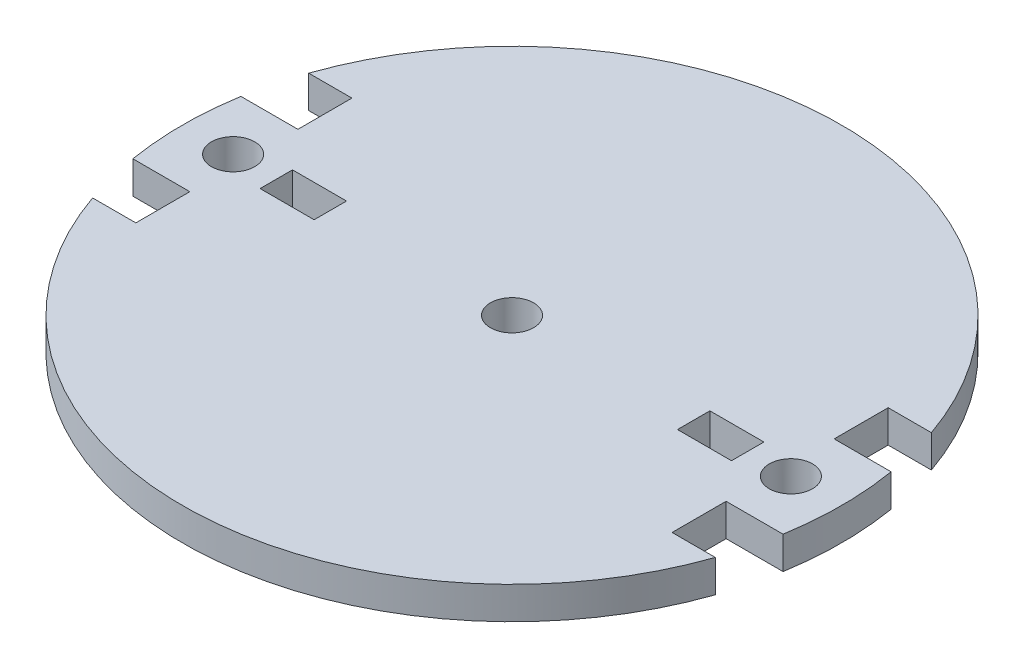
from build123d import *

# Parameters (mm, degrees)
CROQUIS1_R              = 30.5
SALIENTE_EXTRUIR1_DEPTH = 3
CROQUIS2_R              = 2
CORTAR_EXTRUIR1_DEPTH   = 4
CORTAR_EXTRUIR3_START   = -4
CORTAR_EXTRUIR3_DEPTH   = 4
CROQUIS6_W              = 5
CROQUIS6_H              = 3
CORTAR_EXTRUIR4_DEPTH   = 4
CROQUIS7_R              = 2
CORTAR_EXTRUIR5_DEPTH   = 4


with BuildPart() as part:
    # Croquis1 → Saliente-Extruir1 (new body)
    with BuildSketch(Plane(origin=(0, 0, 0), x_dir=(1, 0, 0), z_dir=(0, 1, 0))):
        with Locations(Location((0, 0, 0), (0, 0, 270))):
            Circle(CROQUIS1_R)
    extrude(amount=SALIENTE_EXTRUIR1_DEPTH)

    # Croquis2 → Cortar-Extruir1 (cut)
    with BuildSketch(Plane(origin=(0, 3, 0), x_dir=(1, 0, 0), z_dir=(0, 1, 0))):
        with Locations(Location((0, 0, 0), (0, 0, 270))):
            Circle(CROQUIS2_R)
    extrude(amount=-CORTAR_EXTRUIR1_DEPTH, mode=Mode.SUBTRACT)

    # Croquis5 → Cortar-Extruir3 (cut)
    with BuildSketch(Plane(origin=(0, 3, 0), x_dir=(1, 0, 0), z_dir=(0, 1, 0)).offset(CORTAR_EXTRUIR3_START)):
        with BuildLine():
            Line((28.814059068, 5), (30.087372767, 5))
            ThreePointArc((30.087372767, 5), (29.556634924, 7.526973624), (28.814059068, 10))
            Line((28.814059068, 10), (24.814059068, 10))
            Line((24.814059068, 10), (24.814059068, 5))
            Line((24.814059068, 5), (28.814059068, 5))
        make_face()
        with BuildLine():
            Line((30.087372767, -5), (28.814059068, -5))
            Line((28.814059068, -5), (24.814059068, -5))
            Line((24.814059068, -5), (24.814059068, -10))
            Line((24.814059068, -10), (28.814059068, -10))
            ThreePointArc((28.814059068, -10), (29.556634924, -7.526973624), (30.087372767, -5))
        make_face()
        with BuildLine():
            Line((-24.814059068, 5), (-24.814059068, 10))
            Line((-24.814059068, 10), (-28.814059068, 10))
            ThreePointArc((-28.814059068, 10), (-29.556634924, 7.526973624), (-30.087372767, 5))
            Line((-30.087372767, 5), (-28.814059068, 5))
            Line((-28.814059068, 5), (-24.814059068, 5))
        make_face()
        with BuildLine():
            Line((-28.814059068, -10), (-24.814059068, -10))
            Line((-24.814059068, -10), (-24.814059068, -5))
            Line((-24.814059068, -5), (-28.814059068, -5))
            Line((-28.814059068, -5), (-30.087372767, -5))
            ThreePointArc((-30.087372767, -5), (-29.556634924, -7.526973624), (-28.814059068, -10))
        make_face()
    extrude(amount=CORTAR_EXTRUIR3_DEPTH, mode=Mode.SUBTRACT)

    # Croquis6 → Cortar-Extruir4 (cut)
    with BuildSketch(Plane(origin=(0, 3, 0), x_dir=(1, 0, 0), z_dir=(0, 1, 0))):
        with Locations((19.314059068, 0)):
            Rectangle(CROQUIS6_W, CROQUIS6_H)
        with Locations((-19.314059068, 0)):
            Rectangle(CROQUIS6_W, CROQUIS6_H)
    extrude(amount=-CORTAR_EXTRUIR4_DEPTH, mode=Mode.SUBTRACT)

    # Croquis7 → Cortar-Extruir5 (cut)
    with BuildSketch(Plane(origin=(0, 3, 0), x_dir=(1, 0, 0), z_dir=(0, 1, 0))):
        with Locations(Location((-25.814059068, 0, 0), (0, 0, 270))):
            Circle(CROQUIS7_R)
        with Locations(Location((25.814059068, 0, 0), (0, 0, 270))):
            Circle(CROQUIS7_R)
    extrude(amount=-CORTAR_EXTRUIR5_DEPTH, mode=Mode.SUBTRACT)


solid = part.part
